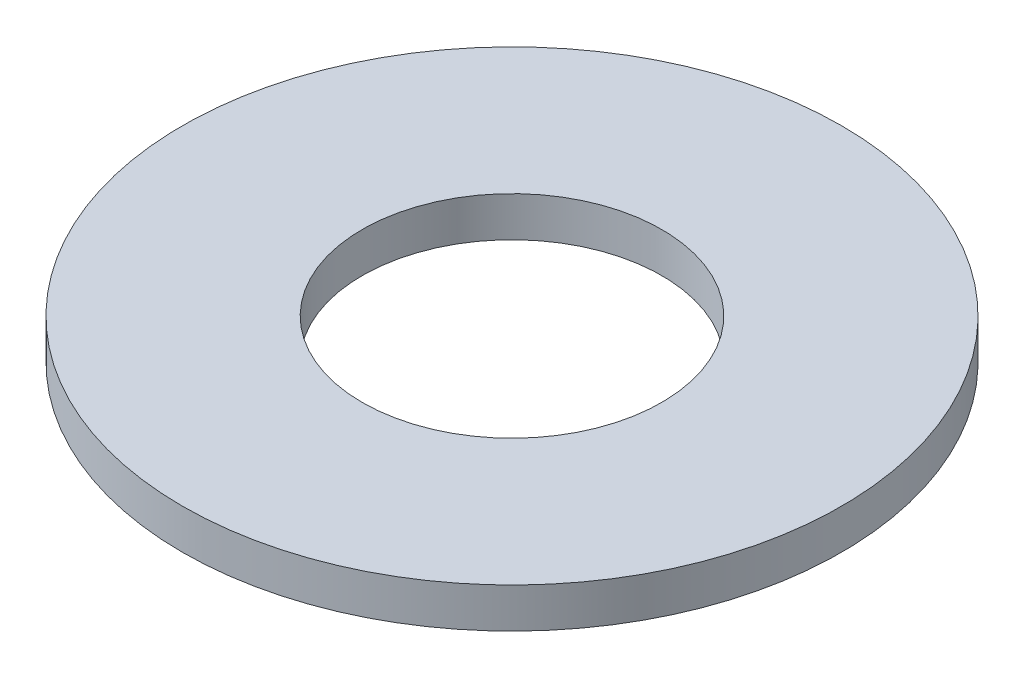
from build123d import *

# Parameters (mm, degrees)
SKETCH1_R           = 82.5
SKETCH1_R_2         = 37.5
BOSS_EXTRUDE1_DEPTH = 10


with BuildPart() as part:
    # Sketch1 → Boss-Extrude1 (new body)
    with BuildSketch(Plane(origin=(0, 0, 0), x_dir=(1, 0, 0), z_dir=(0, 1, 0))):
        with Locations(Location((0, 0, 0), (0, 0, 270))):
            Circle(SKETCH1_R)
        with Locations(Location((0, 0, 0), (0, 0, 270))):
            Circle(SKETCH1_R_2, mode=Mode.SUBTRACT)
    extrude(amount=BOSS_EXTRUDE1_DEPTH)


solid = part.part
